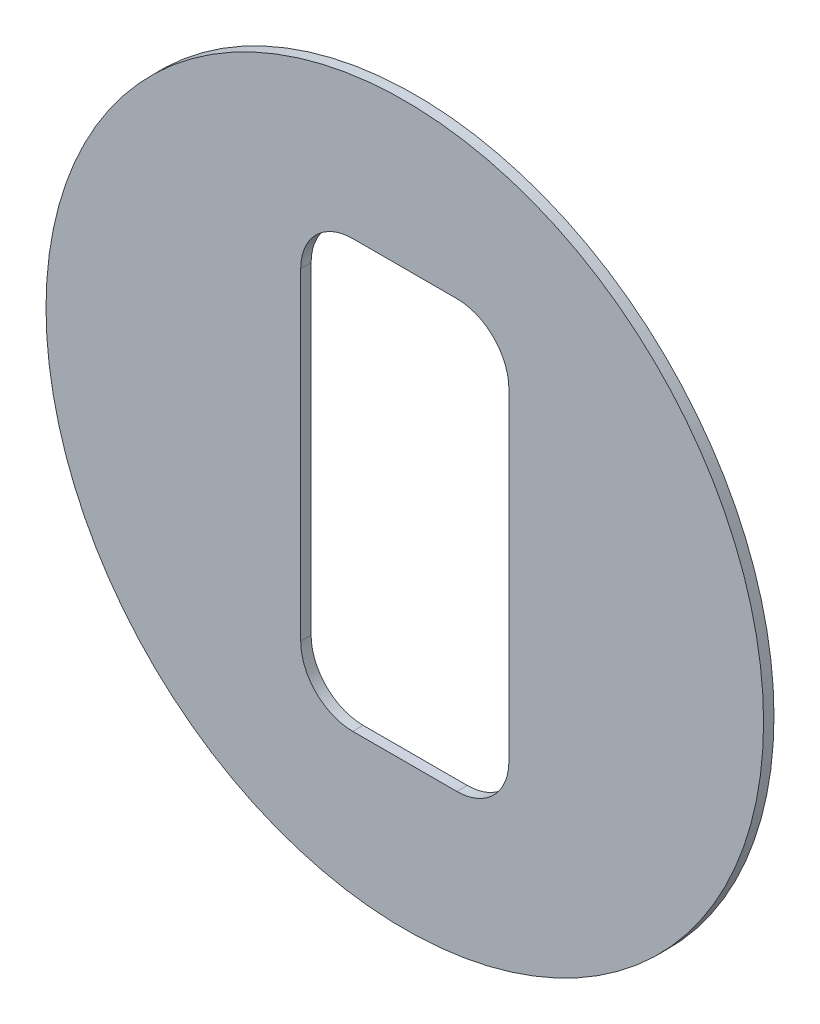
from build123d import *

# Parameters (mm, degrees)
SKETCH1_R           = 1723.5
BOSS_EXTRUDE1_DEPTH = 50
CUT_EXTRUDE1_DEPTH  = 2438.909862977


with BuildPart() as part:
    # Sketch1 → Boss-Extrude1 (new body)
    with BuildSketch(Plane.XY):
        Circle(SKETCH1_R)
    extrude(amount=-BOSS_EXTRUDE1_DEPTH)

    # Sketch2 → Cut-Extrude1 (cut, through all)
    with BuildSketch(Plane.XY):
        with BuildLine():
            Line((250, -1025), (-250, -1025))
            ThreePointArc((-250, -1025), (-426.776695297, -951.776695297), (-500, -775))
            Line((-500, -775), (-500, 775))
            ThreePointArc((-500, 775), (-426.776695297, 951.776695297), (-250, 1025))
            Line((-250, 1025), (250, 1025))
            ThreePointArc((250, 1025), (426.776695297, 951.776695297), (500, 775))
            Line((500, 775), (500, -775))
            ThreePointArc((500, -775), (426.776695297, -951.776695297), (250, -1025))
        make_face()
    extrude(amount=-CUT_EXTRUDE1_DEPTH, mode=Mode.SUBTRACT)


solid = part.part
